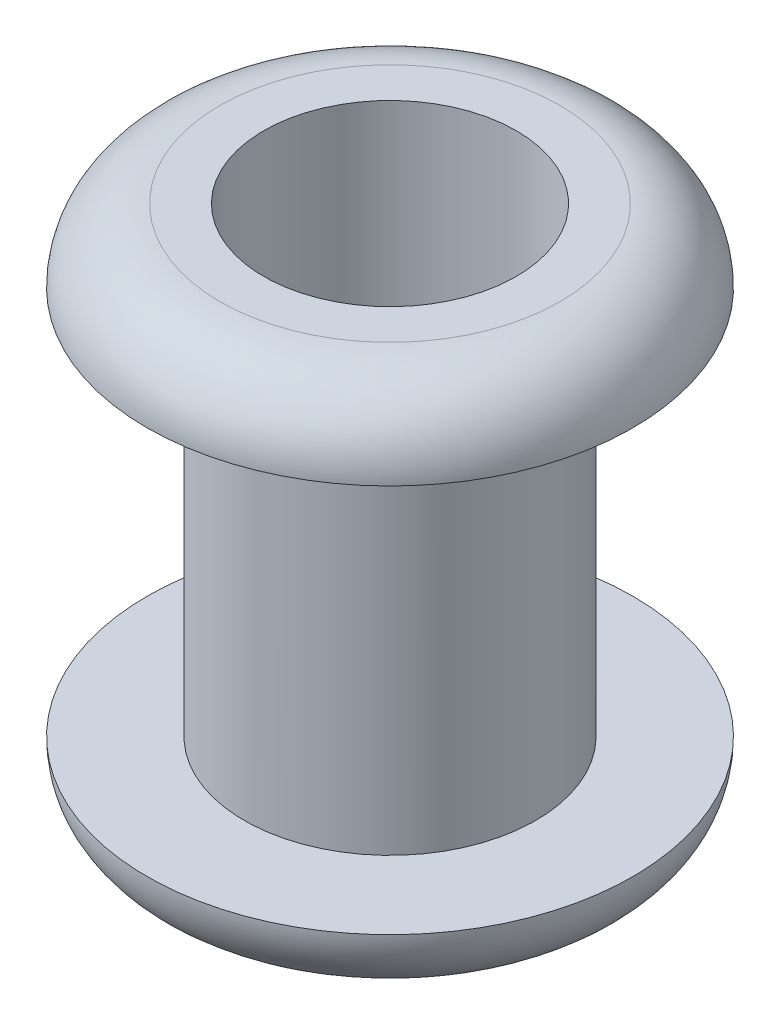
ISO-10303-21;
HEADER;
FILE_DESCRIPTION(('STEP AP214'),'2;1');
FILE_NAME('part.step','',(''),(''),'','','');
FILE_SCHEMA(('AUTOMOTIVE_DESIGN { 1 0 10303 214 1 1 1 1 }'));
ENDSEC;
DATA;
#1=APPLICATION_CONTEXT('core data for automotive mechanical design processes');
#2=APPLICATION_PROTOCOL_DEFINITION('international standard','automotive_design',2000,#1);
#3=PRODUCT_CONTEXT('',#1,'mechanical');
#4=PRODUCT('Part','Part','',(#3));
#5=PRODUCT_RELATED_PRODUCT_CATEGORY('part','',(#4));
#6=PRODUCT_DEFINITION_FORMATION('','',#4);
#7=PRODUCT_DEFINITION_CONTEXT('part definition',#1,'design');
#8=PRODUCT_DEFINITION('design','',#6,#7);
#9=PRODUCT_DEFINITION_SHAPE('','',#8);
#10=(LENGTH_UNIT() NAMED_UNIT(*) SI_UNIT(.MILLI.,.METRE.));
#11=(NAMED_UNIT(*) PLANE_ANGLE_UNIT() SI_UNIT($,.RADIAN.));
#12=(NAMED_UNIT(*) SI_UNIT($,.STERADIAN.) SOLID_ANGLE_UNIT());
#13=UNCERTAINTY_MEASURE_WITH_UNIT(LENGTH_MEASURE(1.E-05),#10,'distance_accuracy_value','');
#14=(GEOMETRIC_REPRESENTATION_CONTEXT(3) GLOBAL_UNCERTAINTY_ASSIGNED_CONTEXT((#13)) GLOBAL_UNIT_ASSIGNED_CONTEXT((#10,
#11,#12)) REPRESENTATION_CONTEXT('',''));
#15=CARTESIAN_POINT('',(0.,0.,0.));
#16=DIRECTION('',(0.,0.,1.));
#17=DIRECTION('',(1.,0.,0.));
#18=AXIS2_PLACEMENT_3D('',#15,#16,#17);
#19=CARTESIAN_POINT('',(0.,4.,0.));
#20=DIRECTION('',(0.,-1.,0.));
#21=DIRECTION('',(0.,0.,-1.));
#22=AXIS2_PLACEMENT_3D('',#19,#20,#21);
#23=CYLINDRICAL_SURFACE('',#22,1.5);
#24=CARTESIAN_POINT('',(0.,4.,0.));
#25=DIRECTION('',(0.,1.,0.));
#26=DIRECTION('',(0.,0.,1.));
#27=AXIS2_PLACEMENT_3D('',#24,#25,#26);
#28=CIRCLE('',#27,1.5);
#29=CARTESIAN_POINT('',(0.,4.,1.5));
#30=VERTEX_POINT('',#29);
#31=EDGE_CURVE('E40',#30,#30,#28,.T.);
#32=ORIENTED_EDGE('',*,*,#31,.F.);
#33=EDGE_LOOP('',(#32));
#34=FACE_BOUND('',#33,.T.);
#35=CARTESIAN_POINT('',(0.,0.,0.));
#36=DIRECTION('',(0.,-1.,0.));
#37=DIRECTION('',(0.,0.,-1.));
#38=AXIS2_PLACEMENT_3D('',#35,#36,#37);
#39=CIRCLE('',#38,1.5);
#40=CARTESIAN_POINT('',(0.,0.,-1.5));
#41=VERTEX_POINT('',#40);
#42=EDGE_CURVE('E49',#41,#41,#39,.T.);
#43=ORIENTED_EDGE('',*,*,#42,.F.);
#44=EDGE_LOOP('',(#43));
#45=FACE_BOUND('',#44,.T.);
#46=ADVANCED_FACE('F29',(#34,#45),#23,.T.);
#47=CARTESIAN_POINT('',(0.,4.,0.));
#48=DIRECTION('',(0.,1.,0.));
#49=DIRECTION('',(0.,0.,1.));
#50=AXIS2_PLACEMENT_3D('',#47,#48,#49);
#51=PLANE('',#50);
#52=CARTESIAN_POINT('',(0.,4.,0.));
#53=DIRECTION('',(0.,1.,0.));
#54=DIRECTION('',(0.,0.,1.));
#55=AXIS2_PLACEMENT_3D('',#52,#53,#54);
#56=CIRCLE('',#55,2.5);
#57=CARTESIAN_POINT('',(0.,4.,2.5));
#58=VERTEX_POINT('',#57);
#59=EDGE_CURVE('E44',#58,#58,#56,.T.);
#60=ORIENTED_EDGE('',*,*,#59,.F.);
#61=EDGE_LOOP('',(#60));
#62=FACE_BOUND('',#61,.T.);
#63=ORIENTED_EDGE('',*,*,#31,.T.);
#64=EDGE_LOOP('',(#63));
#65=FACE_BOUND('',#64,.T.);
#66=ADVANCED_FACE('F81',(#62,#65),#51,.F.);
#67=CARTESIAN_POINT('',(0.,4.75,0.));
#68=DIRECTION('',(0.,1.,0.));
#69=DIRECTION('',(0.,0.,1.));
#70=AXIS2_PLACEMENT_3D('',#67,#68,#69);
#71=PLANE('',#70);
#72=CARTESIAN_POINT('',(0.,4.75,0.));
#73=DIRECTION('',(0.,1.,0.));
#74=DIRECTION('',(0.,0.,1.));
#75=AXIS2_PLACEMENT_3D('',#72,#73,#74);
#76=CIRCLE('',#75,1.75);
#77=CARTESIAN_POINT('',(0.,4.75,1.75));
#78=VERTEX_POINT('',#77);
#79=EDGE_CURVE('E10',#78,#78,#76,.T.);
#80=ORIENTED_EDGE('',*,*,#79,.T.);
#81=EDGE_LOOP('',(#80));
#82=FACE_BOUND('',#81,.T.);
#83=CARTESIAN_POINT('',(0.,4.75,0.));
#84=DIRECTION('',(0.,-1.,0.));
#85=DIRECTION('',(0.,0.,-1.));
#86=AXIS2_PLACEMENT_3D('',#83,#84,#85);
#87=CIRCLE('',#86,1.3);
#88=CARTESIAN_POINT('',(0.,4.75,-1.3));
#89=VERTEX_POINT('',#88);
#90=EDGE_CURVE('E55',#89,#89,#87,.T.);
#91=ORIENTED_EDGE('',*,*,#90,.T.);
#92=EDGE_LOOP('',(#91));
#93=FACE_BOUND('',#92,.T.);
#94=ADVANCED_FACE('F62',(#82,#93),#71,.T.);
#95=CARTESIAN_POINT('',(0.,0.,0.));
#96=DIRECTION('',(0.,-1.,0.));
#97=DIRECTION('',(0.,0.,-1.));
#98=AXIS2_PLACEMENT_3D('',#95,#96,#97);
#99=PLANE('',#98);
#100=CARTESIAN_POINT('',(0.,0.,0.));
#101=DIRECTION('',(0.,-1.,0.));
#102=DIRECTION('',(0.,0.,-1.));
#103=AXIS2_PLACEMENT_3D('',#100,#101,#102);
#104=CIRCLE('',#103,2.5);
#105=CARTESIAN_POINT('',(0.,0.,-2.5));
#106=VERTEX_POINT('',#105);
#107=EDGE_CURVE('E52',#106,#106,#104,.T.);
#108=ORIENTED_EDGE('',*,*,#107,.F.);
#109=EDGE_LOOP('',(#108));
#110=FACE_BOUND('',#109,.T.);
#111=ORIENTED_EDGE('',*,*,#42,.T.);
#112=EDGE_LOOP('',(#111));
#113=FACE_BOUND('',#112,.T.);
#114=ADVANCED_FACE('F73',(#110,#113),#99,.F.);
#115=CARTESIAN_POINT('',(0.,-0.75,0.));
#116=DIRECTION('',(0.,-1.,0.));
#117=DIRECTION('',(0.,0.,-1.));
#118=AXIS2_PLACEMENT_3D('',#115,#116,#117);
#119=PLANE('',#118);
#120=CARTESIAN_POINT('',(0.,-0.75,0.));
#121=DIRECTION('',(0.,-1.,0.));
#122=DIRECTION('',(0.,0.,-1.));
#123=AXIS2_PLACEMENT_3D('',#120,#121,#122);
#124=CIRCLE('',#123,1.75);
#125=CARTESIAN_POINT('',(0.,-0.75,-1.75));
#126=VERTEX_POINT('',#125);
#127=EDGE_CURVE('E36',#126,#126,#124,.T.);
#128=ORIENTED_EDGE('',*,*,#127,.T.);
#129=EDGE_LOOP('',(#128));
#130=FACE_BOUND('',#129,.T.);
#131=CARTESIAN_POINT('',(0.,-0.75,0.));
#132=DIRECTION('',(0.,-1.,0.));
#133=DIRECTION('',(0.,0.,-1.));
#134=AXIS2_PLACEMENT_3D('',#131,#132,#133);
#135=CIRCLE('',#134,1.3);
#136=CARTESIAN_POINT('',(0.,-0.75,-1.3));
#137=VERTEX_POINT('',#136);
#138=EDGE_CURVE('E56',#137,#137,#135,.T.);
#139=ORIENTED_EDGE('',*,*,#138,.F.);
#140=EDGE_LOOP('',(#139));
#141=FACE_BOUND('',#140,.T.);
#142=ADVANCED_FACE('F68',(#130,#141),#119,.T.);
#143=CARTESIAN_POINT('',(0.,4.75,0.));
#144=DIRECTION('',(0.,-1.,0.));
#145=DIRECTION('',(0.,0.,-1.));
#146=AXIS2_PLACEMENT_3D('',#143,#144,#145);
#147=CYLINDRICAL_SURFACE('',#146,1.3);
#148=ORIENTED_EDGE('',*,*,#90,.F.);
#149=EDGE_LOOP('',(#148));
#150=FACE_BOUND('',#149,.T.);
#151=ORIENTED_EDGE('',*,*,#138,.T.);
#152=EDGE_LOOP('',(#151));
#153=FACE_BOUND('',#152,.T.);
#154=ADVANCED_FACE('F64',(#150,#153),#147,.F.);
#155=CARTESIAN_POINT('',(0.,0.,0.));
#156=DIRECTION('',(0.,-1.,0.));
#157=DIRECTION('',(0.,0.,-1.));
#158=AXIS2_PLACEMENT_3D('',#155,#156,#157);
#159=TOROIDAL_SURFACE('',#158,1.75,0.75);
#160=ORIENTED_EDGE('',*,*,#107,.T.);
#161=EDGE_LOOP('',(#160));
#162=FACE_BOUND('',#161,.T.);
#163=ORIENTED_EDGE('',*,*,#127,.F.);
#164=EDGE_LOOP('',(#163));
#165=FACE_BOUND('',#164,.T.);
#166=ADVANCED_FACE('F67',(#162,#165),#159,.T.);
#167=CARTESIAN_POINT('',(0.,4.,0.));
#168=DIRECTION('',(0.,1.,0.));
#169=DIRECTION('',(0.,0.,1.));
#170=AXIS2_PLACEMENT_3D('',#167,#168,#169);
#171=TOROIDAL_SURFACE('',#170,1.75,0.75);
#172=ORIENTED_EDGE('',*,*,#59,.T.);
#173=EDGE_LOOP('',(#172));
#174=FACE_BOUND('',#173,.T.);
#175=ORIENTED_EDGE('',*,*,#79,.F.);
#176=EDGE_LOOP('',(#175));
#177=FACE_BOUND('',#176,.T.);
#178=ADVANCED_FACE('F31',(#174,#177),#171,.T.);
#179=CLOSED_SHELL('',(#46,#66,#94,#114,#142,#154,#166,#178));
#180=MANIFOLD_SOLID_BREP('B2',#179);
#181=ADVANCED_BREP_SHAPE_REPRESENTATION('',(#18,#180),#14);
#182=SHAPE_DEFINITION_REPRESENTATION(#9,#181);
ENDSEC;
END-ISO-10303-21;
